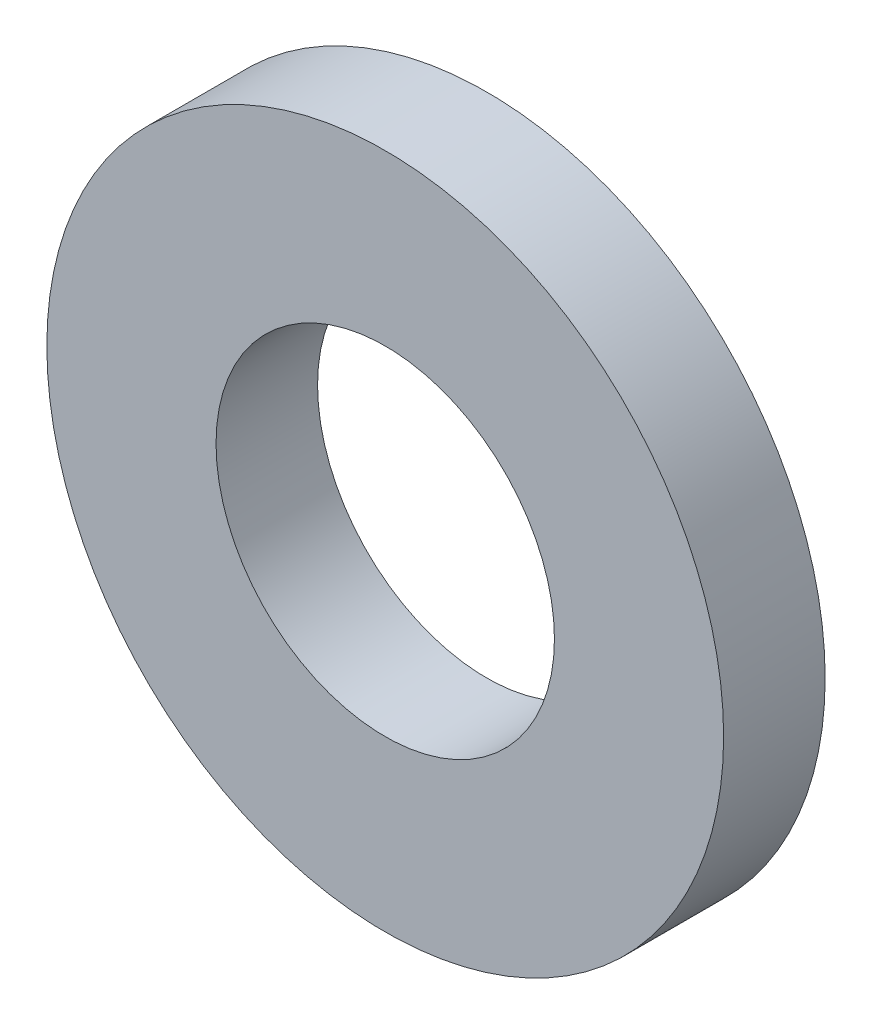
ISO-10303-21;
HEADER;
FILE_DESCRIPTION(('STEP AP214'),'2;1');
FILE_NAME('part.step','',(''),(''),'','','');
FILE_SCHEMA(('AUTOMOTIVE_DESIGN { 1 0 10303 214 1 1 1 1 }'));
ENDSEC;
DATA;
#1=APPLICATION_CONTEXT('core data for automotive mechanical design processes');
#2=APPLICATION_PROTOCOL_DEFINITION('international standard','automotive_design',2000,#1);
#3=PRODUCT_CONTEXT('',#1,'mechanical');
#4=PRODUCT('Part','Part','',(#3));
#5=PRODUCT_RELATED_PRODUCT_CATEGORY('part','',(#4));
#6=PRODUCT_DEFINITION_FORMATION('','',#4);
#7=PRODUCT_DEFINITION_CONTEXT('part definition',#1,'design');
#8=PRODUCT_DEFINITION('design','',#6,#7);
#9=PRODUCT_DEFINITION_SHAPE('','',#8);
#10=(LENGTH_UNIT() NAMED_UNIT(*) SI_UNIT(.MILLI.,.METRE.));
#11=(NAMED_UNIT(*) PLANE_ANGLE_UNIT() SI_UNIT($,.RADIAN.));
#12=(NAMED_UNIT(*) SI_UNIT($,.STERADIAN.) SOLID_ANGLE_UNIT());
#13=UNCERTAINTY_MEASURE_WITH_UNIT(LENGTH_MEASURE(1.E-05),#10,'distance_accuracy_value','');
#14=(GEOMETRIC_REPRESENTATION_CONTEXT(3) GLOBAL_UNCERTAINTY_ASSIGNED_CONTEXT((#13)) GLOBAL_UNIT_ASSIGNED_CONTEXT((#10,
#11,#12)) REPRESENTATION_CONTEXT('',''));
#15=CARTESIAN_POINT('',(0.,0.,0.));
#16=DIRECTION('',(0.,0.,1.));
#17=DIRECTION('',(1.,0.,0.));
#18=AXIS2_PLACEMENT_3D('',#15,#16,#17);
#19=CARTESIAN_POINT('',(0.,0.,1.5));
#20=DIRECTION('',(0.,0.,1.));
#21=DIRECTION('',(1.,0.,0.));
#22=AXIS2_PLACEMENT_3D('',#19,#20,#21);
#23=PLANE('',#22);
#24=CARTESIAN_POINT('',(0.,0.,1.5));
#25=DIRECTION('',(0.,0.,1.));
#26=DIRECTION('',(1.,0.,0.));
#27=AXIS2_PLACEMENT_3D('',#24,#25,#26);
#28=CIRCLE('',#27,5.);
#29=CARTESIAN_POINT('',(5.,0.,1.5));
#30=VERTEX_POINT('',#29);
#31=EDGE_CURVE('E10',#30,#30,#28,.T.);
#32=ORIENTED_EDGE('',*,*,#31,.T.);
#33=EDGE_LOOP('',(#32));
#34=FACE_BOUND('',#33,.T.);
#35=CARTESIAN_POINT('',(0.,0.,1.5));
#36=DIRECTION('',(0.,0.,1.));
#37=DIRECTION('',(1.,0.,0.));
#38=AXIS2_PLACEMENT_3D('',#35,#36,#37);
#39=CIRCLE('',#38,2.5);
#40=CARTESIAN_POINT('',(2.5,0.,1.5));
#41=VERTEX_POINT('',#40);
#42=EDGE_CURVE('E41',#41,#41,#39,.T.);
#43=ORIENTED_EDGE('',*,*,#42,.F.);
#44=EDGE_LOOP('',(#43));
#45=FACE_BOUND('',#44,.T.);
#46=ADVANCED_FACE('F30',(#34,#45),#23,.T.);
#47=CARTESIAN_POINT('',(0.,0.,0.));
#48=DIRECTION('',(0.,0.,1.));
#49=DIRECTION('',(1.,0.,0.));
#50=AXIS2_PLACEMENT_3D('',#47,#48,#49);
#51=PLANE('',#50);
#52=CARTESIAN_POINT('',(0.,0.,0.));
#53=DIRECTION('',(0.,0.,1.));
#54=DIRECTION('',(1.,0.,0.));
#55=AXIS2_PLACEMENT_3D('',#52,#53,#54);
#56=CIRCLE('',#55,5.);
#57=CARTESIAN_POINT('',(5.,0.,0.));
#58=VERTEX_POINT('',#57);
#59=EDGE_CURVE('E34',#58,#58,#56,.T.);
#60=ORIENTED_EDGE('',*,*,#59,.F.);
#61=EDGE_LOOP('',(#60));
#62=FACE_BOUND('',#61,.T.);
#63=CARTESIAN_POINT('',(0.,0.,0.));
#64=DIRECTION('',(0.,0.,1.));
#65=DIRECTION('',(1.,0.,0.));
#66=AXIS2_PLACEMENT_3D('',#63,#64,#65);
#67=CIRCLE('',#66,2.5);
#68=CARTESIAN_POINT('',(2.5,0.,0.));
#69=VERTEX_POINT('',#68);
#70=EDGE_CURVE('E43',#69,#69,#67,.T.);
#71=ORIENTED_EDGE('',*,*,#70,.T.);
#72=EDGE_LOOP('',(#71));
#73=FACE_BOUND('',#72,.T.);
#74=ADVANCED_FACE('F53',(#62,#73),#51,.F.);
#75=CARTESIAN_POINT('',(0.,0.,1.5));
#76=DIRECTION('',(0.,0.,-1.));
#77=DIRECTION('',(-1.,0.,0.));
#78=AXIS2_PLACEMENT_3D('',#75,#76,#77);
#79=CYLINDRICAL_SURFACE('',#78,5.);
#80=ORIENTED_EDGE('',*,*,#31,.F.);
#81=EDGE_LOOP('',(#80));
#82=FACE_BOUND('',#81,.T.);
#83=ORIENTED_EDGE('',*,*,#59,.T.);
#84=EDGE_LOOP('',(#83));
#85=FACE_BOUND('',#84,.T.);
#86=ADVANCED_FACE('F32',(#82,#85),#79,.T.);
#87=CARTESIAN_POINT('',(0.,0.,1.5));
#88=DIRECTION('',(0.,0.,-1.));
#89=DIRECTION('',(-1.,0.,0.));
#90=AXIS2_PLACEMENT_3D('',#87,#88,#89);
#91=CYLINDRICAL_SURFACE('',#90,2.5);
#92=ORIENTED_EDGE('',*,*,#42,.T.);
#93=EDGE_LOOP('',(#92));
#94=FACE_BOUND('',#93,.T.);
#95=ORIENTED_EDGE('',*,*,#70,.F.);
#96=EDGE_LOOP('',(#95));
#97=FACE_BOUND('',#96,.T.);
#98=ADVANCED_FACE('F49',(#94,#97),#91,.F.);
#99=CLOSED_SHELL('',(#46,#74,#86,#98));
#100=MANIFOLD_SOLID_BREP('B2',#99);
#101=ADVANCED_BREP_SHAPE_REPRESENTATION('',(#18,#100),#14);
#102=SHAPE_DEFINITION_REPRESENTATION(#9,#101);
ENDSEC;
END-ISO-10303-21;
